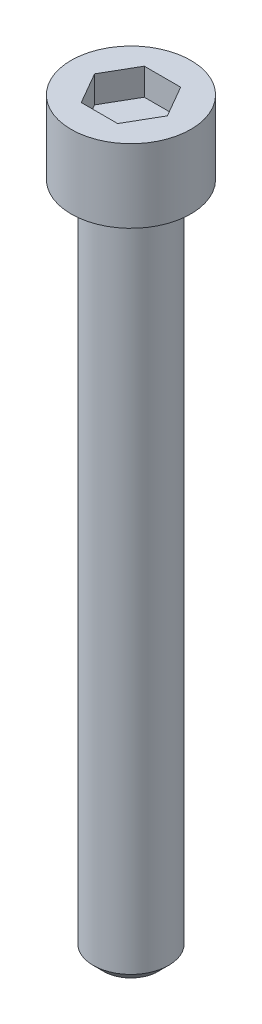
from build123d import *

# Parameters (mm, degrees)
CUT_EXTRUDE1_DEPTH = 1.016


with BuildPart() as part:
    # Sketch1 → Base-Revolve (revolve)
    with BuildSketch(Plane.XY, mode=Mode.PRIVATE) as base_revolve_sk:
        Polygon((0, 2.7686), (2.2606, 2.7686), (2.2606, 0), (1.4224, 0), (1.4224, -25.003125), (1.025525, -25.4), (0, -25.4), align=None)
    revolve(base_revolve_sk.sketch.rotate(Axis((0, 17.272, 0), (0, -1, 0)), 90), axis=Axis((0, 17.272, 0), (0, -1, 0)))

    # Sketch2 → Cut-Extrude1 (cut)
    with BuildSketch(Plane(origin=(0, 2.7686, 0), x_dir=(-1, 0, 0), z_dir=(0, 1, 0))):
        Polygon((-1.374815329, 0), (-0.687407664, -1.190625), (0.687407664, -1.190625), (1.374815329, 0), (0.687407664, 1.190625), (-0.687407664, 1.190625), align=None)
    extrude(amount=-CUT_EXTRUDE1_DEPTH, mode=Mode.SUBTRACT)


solid = part.part
